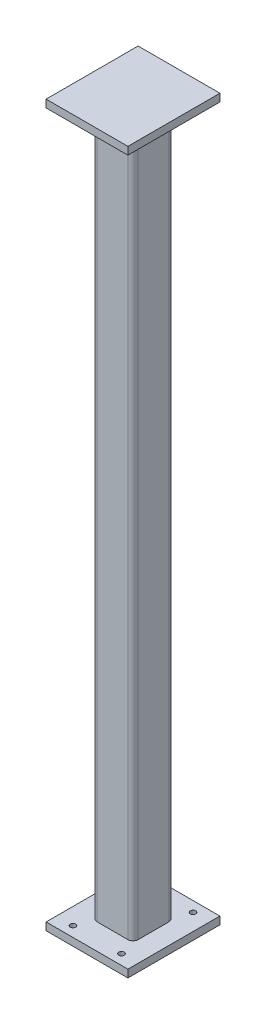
from build123d import *

# Parameters (mm, degrees)
SKETCH1_W                   = 101.6
SKETCH1_H                   = 114.3
BOSS_EXTRUDE1_DEPTH         = 9.525
SKETCH2_W                   = 50.8
SKETCH2_H                   = 50.8
BOSS_EXTRUDE2_DEPTH         = 875.832699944
SKETCH3_W                   = 101.6
SKETCH3_H                   = 114.3
BOSS_EXTRUDE3_DEPTH         = 9.525
FILLET1_R                   = 6.35
F_1_4_CLEARANCE_HOLE1_D     = 6.7564
F_1_4_CLEARANCE_HOLE1_DEPTH = 9.525


with BuildPart() as part:
    # Sketch1 → Boss-Extrude1 (new body)
    with BuildSketch(Plane(origin=(0, 0, 0), x_dir=(1, 0, 0), z_dir=(0, 1, 0))):
        Rectangle(SKETCH1_W, SKETCH1_H)
    extrude(amount=BOSS_EXTRUDE1_DEPTH)

    # Sketch2 → Boss-Extrude2 (add)
    with BuildSketch(Plane(origin=(0, 9.525, 0), x_dir=(1, 0, 0), z_dir=(0, 1, 0))):
        Rectangle(SKETCH2_W, SKETCH2_H)
    extrude(amount=BOSS_EXTRUDE2_DEPTH)

    # Sketch3 → Boss-Extrude3 (add)
    with BuildSketch(Plane(origin=(0, 885.357699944, 0), x_dir=(1, 0, 0), z_dir=(0, 1, 0))):
        Rectangle(SKETCH3_W, SKETCH3_H)
    extrude(amount=BOSS_EXTRUDE3_DEPTH)

    # Fillet1
    fillet1_edges = [part.edges().sort_by_distance(p)[0] for p in [
        (25.4, 447.441349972, 25.4),
        (25.4, 447.441349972, -25.4),
        (-25.4, 447.441349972, -25.4),
        (-25.4, 447.441349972, 25.4),
    ]]
    fillet(fillet1_edges, radius=FILLET1_R)

    # 1_4 Clearance Hole1
    with Locations(Plane(origin=(0, 9.525, 0), x_dir=(-1, 0, 0), z_dir=(0, 1, 0))):
        with Locations((-30.1625, 44.45), (-30.1625, -44.45), (30.1625, -44.45), (30.1625, 44.45)):
            Hole(F_1_4_CLEARANCE_HOLE1_D / 2, depth=F_1_4_CLEARANCE_HOLE1_DEPTH)


solid = part.part
